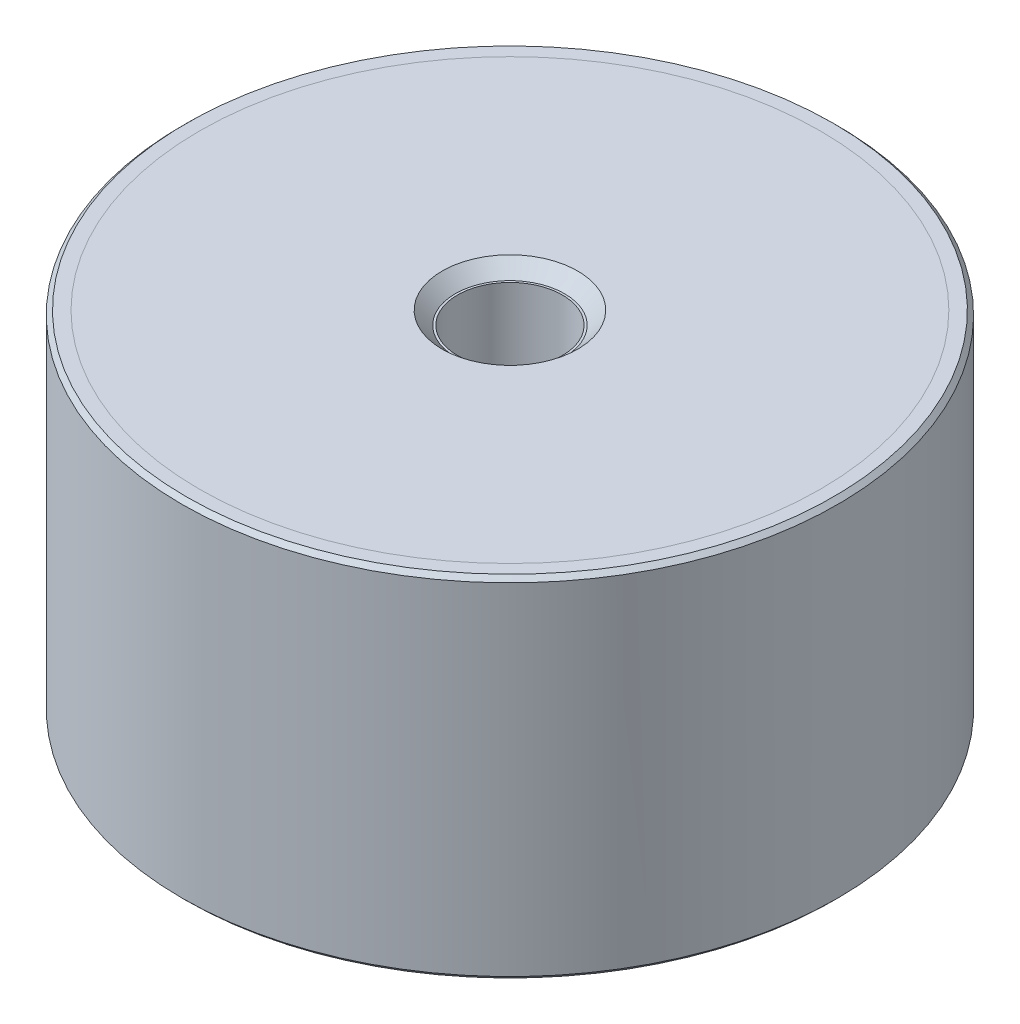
ISO-10303-21;
HEADER;
FILE_DESCRIPTION(('STEP AP214'),'2;1');
FILE_NAME('part.step','',(''),(''),'','','');
FILE_SCHEMA(('AUTOMOTIVE_DESIGN { 1 0 10303 214 1 1 1 1 }'));
ENDSEC;
DATA;
#1=APPLICATION_CONTEXT('core data for automotive mechanical design processes');
#2=APPLICATION_PROTOCOL_DEFINITION('international standard','automotive_design',2000,#1);
#3=PRODUCT_CONTEXT('',#1,'mechanical');
#4=PRODUCT('Part','Part','',(#3));
#5=PRODUCT_RELATED_PRODUCT_CATEGORY('part','',(#4));
#6=PRODUCT_DEFINITION_FORMATION('','',#4);
#7=PRODUCT_DEFINITION_CONTEXT('part definition',#1,'design');
#8=PRODUCT_DEFINITION('design','',#6,#7);
#9=PRODUCT_DEFINITION_SHAPE('','',#8);
#10=(LENGTH_UNIT() NAMED_UNIT(*) SI_UNIT(.MILLI.,.METRE.));
#11=(NAMED_UNIT(*) PLANE_ANGLE_UNIT() SI_UNIT($,.RADIAN.));
#12=(NAMED_UNIT(*) SI_UNIT($,.STERADIAN.) SOLID_ANGLE_UNIT());
#13=UNCERTAINTY_MEASURE_WITH_UNIT(LENGTH_MEASURE(1.E-05),#10,'distance_accuracy_value','');
#14=(GEOMETRIC_REPRESENTATION_CONTEXT(3) GLOBAL_UNCERTAINTY_ASSIGNED_CONTEXT((#13)) GLOBAL_UNIT_ASSIGNED_CONTEXT((#10,
#11,#12)) REPRESENTATION_CONTEXT('',''));
#15=CARTESIAN_POINT('',(0.,0.,0.));
#16=DIRECTION('',(0.,0.,1.));
#17=DIRECTION('',(1.,0.,0.));
#18=AXIS2_PLACEMENT_3D('',#15,#16,#17);
#19=CARTESIAN_POINT('',(0.,-37.,6.));
#20=DIRECTION('',(0.,1.,0.));
#21=DIRECTION('',(0.,0.,1.));
#22=AXIS2_PLACEMENT_3D('',#19,#20,#21);
#23=PLANE('',#22);
#24=CARTESIAN_POINT('',(0.,-37.,0.));
#25=DIRECTION('',(0.,1.,0.));
#26=DIRECTION('',(0.,0.,1.));
#27=AXIS2_PLACEMENT_3D('',#24,#25,#26);
#28=CIRCLE('',#27,6.25000000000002);
#29=CARTESIAN_POINT('',(0.,-37.,6.25000000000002));
#30=VERTEX_POINT('',#29);
#31=EDGE_CURVE('P0_E10',#30,#30,#28,.F.);
#32=ORIENTED_EDGE('',*,*,#31,.T.);
#33=EDGE_LOOP('',(#32));
#34=FACE_BOUND('',#33,.T.);
#35=CARTESIAN_POINT('',(0.,-37.,0.));
#36=DIRECTION('',(0.,1.,0.));
#37=DIRECTION('',(0.,0.,1.));
#38=AXIS2_PLACEMENT_3D('',#35,#36,#37);
#39=CIRCLE('',#38,35.5);
#40=CARTESIAN_POINT('',(0.,-37.,35.5));
#41=VERTEX_POINT('',#40);
#42=EDGE_CURVE('P0_E25',#41,#41,#39,.T.);
#43=ORIENTED_EDGE('',*,*,#42,.T.);
#44=EDGE_LOOP('',(#43));
#45=FACE_BOUND('',#44,.T.);
#46=ADVANCED_FACE('P0_F14',(#34,#45),#23,.T.);
#47=CARTESIAN_POINT('',(0.,31.0340428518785,0.));
#48=DIRECTION('',(0.,1.,0.));
#49=DIRECTION('',(0.,0.,1.));
#50=AXIS2_PLACEMENT_3D('',#47,#48,#49);
#51=CYLINDRICAL_SURFACE('',#50,35.5);
#52=CARTESIAN_POINT('',(0.,-38.5,0.));
#53=DIRECTION('',(0.,1.,0.));
#54=DIRECTION('',(0.,0.,1.));
#55=AXIS2_PLACEMENT_3D('',#52,#53,#54);
#56=CIRCLE('',#55,35.5);
#57=CARTESIAN_POINT('',(0.,-38.5,35.5));
#58=VERTEX_POINT('',#57);
#59=EDGE_CURVE('P0_E29',#58,#58,#56,.T.);
#60=ORIENTED_EDGE('',*,*,#59,.T.);
#61=EDGE_LOOP('',(#60));
#62=FACE_BOUND('',#61,.T.);
#63=ORIENTED_EDGE('',*,*,#42,.F.);
#64=EDGE_LOOP('',(#63));
#65=FACE_BOUND('',#64,.T.);
#66=ADVANCED_FACE('P0_F35',(#62,#65),#51,.T.);
#67=CARTESIAN_POINT('',(0.,-38.5,35.5));
#68=DIRECTION('',(0.,-1.,0.));
#69=DIRECTION('',(0.,0.,-1.));
#70=AXIS2_PLACEMENT_3D('',#67,#68,#69);
#71=PLANE('',#70);
#72=CARTESIAN_POINT('',(0.,-38.5,0.));
#73=DIRECTION('',(0.,-1.,0.));
#74=DIRECTION('',(0.,0.,-1.));
#75=AXIS2_PLACEMENT_3D('',#72,#73,#74);
#76=CIRCLE('',#75,7.75000000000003);
#77=CARTESIAN_POINT('',(0.,-38.5,-7.75000000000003));
#78=VERTEX_POINT('',#77);
#79=EDGE_CURVE('P0_E21',#78,#78,#76,.F.);
#80=ORIENTED_EDGE('',*,*,#79,.T.);
#81=EDGE_LOOP('',(#80));
#82=FACE_BOUND('',#81,.T.);
#83=ORIENTED_EDGE('',*,*,#59,.F.);
#84=EDGE_LOOP('',(#83));
#85=FACE_BOUND('',#84,.T.);
#86=ADVANCED_FACE('P0_F38',(#82,#85),#71,.T.);
#87=CARTESIAN_POINT('',(0.,-38.5,0.));
#88=DIRECTION('',(0.,-1.,0.));
#89=DIRECTION('',(0.,0.,-1.));
#90=AXIS2_PLACEMENT_3D('',#87,#88,#89);
#91=CONICAL_SURFACE('',#90,7.75000000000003,0.785398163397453);
#92=ORIENTED_EDGE('',*,*,#31,.F.);
#93=EDGE_LOOP('',(#92));
#94=FACE_BOUND('',#93,.T.);
#95=ORIENTED_EDGE('',*,*,#79,.F.);
#96=EDGE_LOOP('',(#95));
#97=FACE_BOUND('',#96,.T.);
#98=ADVANCED_FACE('P0_F16',(#94,#97),#91,.F.);
#99=CLOSED_SHELL('',(#46,#66,#86,#98));
#100=MANIFOLD_SOLID_BREP('P0_B1',#99);
#101=CARTESIAN_POINT('',(0.,1.5,6.));
#102=DIRECTION('',(0.,1.,0.));
#103=DIRECTION('',(0.,0.,1.));
#104=AXIS2_PLACEMENT_3D('',#101,#102,#103);
#105=PLANE('',#104);
#106=CARTESIAN_POINT('',(0.,1.5,0.));
#107=DIRECTION('',(0.,1.,0.));
#108=DIRECTION('',(0.,0.,1.));
#109=AXIS2_PLACEMENT_3D('',#106,#107,#108);
#110=CIRCLE('',#109,7.75000000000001);
#111=CARTESIAN_POINT('',(0.,1.5,7.75000000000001));
#112=VERTEX_POINT('',#111);
#113=EDGE_CURVE('P1_E10',#112,#112,#110,.F.);
#114=ORIENTED_EDGE('',*,*,#113,.T.);
#115=EDGE_LOOP('',(#114));
#116=FACE_BOUND('',#115,.T.);
#117=CARTESIAN_POINT('',(0.,1.5,0.));
#118=DIRECTION('',(0.,1.,0.));
#119=DIRECTION('',(0.,0.,1.));
#120=AXIS2_PLACEMENT_3D('',#117,#118,#119);
#121=CIRCLE('',#120,35.5);
#122=CARTESIAN_POINT('',(0.,1.5,35.5));
#123=VERTEX_POINT('',#122);
#124=EDGE_CURVE('P1_E25',#123,#123,#121,.T.);
#125=ORIENTED_EDGE('',*,*,#124,.T.);
#126=EDGE_LOOP('',(#125));
#127=FACE_BOUND('',#126,.T.);
#128=ADVANCED_FACE('P1_F14',(#116,#127),#105,.T.);
#129=CARTESIAN_POINT('',(0.,69.5340428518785,0.));
#130=DIRECTION('',(0.,1.,0.));
#131=DIRECTION('',(0.,0.,1.));
#132=AXIS2_PLACEMENT_3D('',#129,#130,#131);
#133=CYLINDRICAL_SURFACE('',#132,35.5);
#134=CARTESIAN_POINT('',(0.,0.,0.));
#135=DIRECTION('',(0.,1.,0.));
#136=DIRECTION('',(0.,0.,1.));
#137=AXIS2_PLACEMENT_3D('',#134,#135,#136);
#138=CIRCLE('',#137,35.5);
#139=CARTESIAN_POINT('',(0.,0.,35.5));
#140=VERTEX_POINT('',#139);
#141=EDGE_CURVE('P1_E29',#140,#140,#138,.T.);
#142=ORIENTED_EDGE('',*,*,#141,.T.);
#143=EDGE_LOOP('',(#142));
#144=FACE_BOUND('',#143,.T.);
#145=ORIENTED_EDGE('',*,*,#124,.F.);
#146=EDGE_LOOP('',(#145));
#147=FACE_BOUND('',#146,.T.);
#148=ADVANCED_FACE('P1_F35',(#144,#147),#133,.T.);
#149=CARTESIAN_POINT('',(0.,0.,35.5));
#150=DIRECTION('',(0.,-1.,0.));
#151=DIRECTION('',(0.,0.,-1.));
#152=AXIS2_PLACEMENT_3D('',#149,#150,#151);
#153=PLANE('',#152);
#154=CARTESIAN_POINT('',(0.,0.,0.));
#155=DIRECTION('',(0.,-1.,0.));
#156=DIRECTION('',(0.,0.,-1.));
#157=AXIS2_PLACEMENT_3D('',#154,#155,#156);
#158=CIRCLE('',#157,6.25000000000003);
#159=CARTESIAN_POINT('',(0.,0.,-6.25000000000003));
#160=VERTEX_POINT('',#159);
#161=EDGE_CURVE('P1_E21',#160,#160,#158,.F.);
#162=ORIENTED_EDGE('',*,*,#161,.T.);
#163=EDGE_LOOP('',(#162));
#164=FACE_BOUND('',#163,.T.);
#165=ORIENTED_EDGE('',*,*,#141,.F.);
#166=EDGE_LOOP('',(#165));
#167=FACE_BOUND('',#166,.T.);
#168=ADVANCED_FACE('P1_F38',(#164,#167),#153,.T.);
#169=CARTESIAN_POINT('',(0.,-0.250000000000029,0.));
#170=DIRECTION('',(0.,1.,0.));
#171=DIRECTION('',(0.,0.,1.));
#172=AXIS2_PLACEMENT_3D('',#169,#170,#171);
#173=CONICAL_SURFACE('',#172,6.,0.785398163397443);
#174=ORIENTED_EDGE('',*,*,#113,.F.);
#175=EDGE_LOOP('',(#174));
#176=FACE_BOUND('',#175,.T.);
#177=ORIENTED_EDGE('',*,*,#161,.F.);
#178=EDGE_LOOP('',(#177));
#179=FACE_BOUND('',#178,.T.);
#180=ADVANCED_FACE('P1_F16',(#176,#179),#173,.F.);
#181=CLOSED_SHELL('',(#128,#148,#168,#180));
#182=MANIFOLD_SOLID_BREP('P1_B1',#181);
#183=CARTESIAN_POINT('',(0.,0.,0.));
#184=DIRECTION('',(0.,1.,0.));
#185=DIRECTION('',(0.,0.,1.));
#186=AXIS2_PLACEMENT_3D('',#183,#184,#185);
#187=PLANE('',#186);
#188=CARTESIAN_POINT('',(0.,0.,0.));
#189=DIRECTION('',(0.,1.,0.));
#190=DIRECTION('',(0.,0.,1.));
#191=AXIS2_PLACEMENT_3D('',#188,#189,#190);
#192=CIRCLE('',#191,6.);
#193=CARTESIAN_POINT('',(0.,0.,6.));
#194=VERTEX_POINT('',#193);
#195=EDGE_CURVE('P2_E46',#194,#194,#192,.T.);
#196=ORIENTED_EDGE('',*,*,#195,.F.);
#197=EDGE_LOOP('',(#196));
#198=FACE_BOUND('',#197,.T.);
#199=CARTESIAN_POINT('',(0.,0.,0.));
#200=DIRECTION('',(0.,1.,0.));
#201=DIRECTION('',(0.,0.,1.));
#202=AXIS2_PLACEMENT_3D('',#199,#200,#201);
#203=CIRCLE('',#202,35.5);
#204=CARTESIAN_POINT('',(0.,0.,35.5));
#205=VERTEX_POINT('',#204);
#206=EDGE_CURVE('P2_E33',#205,#205,#203,.T.);
#207=ORIENTED_EDGE('',*,*,#206,.T.);
#208=EDGE_LOOP('',(#207));
#209=FACE_BOUND('',#208,.T.);
#210=ADVANCED_FACE('P2_F13',(#198,#209),#187,.T.);
#211=CARTESIAN_POINT('',(0.,65.5134936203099,0.));
#212=DIRECTION('',(0.,1.,0.));
#213=DIRECTION('',(0.,0.,1.));
#214=AXIS2_PLACEMENT_3D('',#211,#212,#213);
#215=CYLINDRICAL_SURFACE('',#214,35.5);
#216=CARTESIAN_POINT('',(0.,1.5,0.));
#217=DIRECTION('',(0.,1.,0.));
#218=DIRECTION('',(0.,0.,1.));
#219=AXIS2_PLACEMENT_3D('',#216,#217,#218);
#220=CIRCLE('',#219,35.5);
#221=CARTESIAN_POINT('',(0.,1.5,35.5));
#222=VERTEX_POINT('',#221);
#223=EDGE_CURVE('P2_E36',#222,#222,#220,.T.);
#224=ORIENTED_EDGE('',*,*,#223,.T.);
#225=EDGE_LOOP('',(#224));
#226=FACE_BOUND('',#225,.T.);
#227=ORIENTED_EDGE('',*,*,#206,.F.);
#228=EDGE_LOOP('',(#227));
#229=FACE_BOUND('',#228,.T.);
#230=ADVANCED_FACE('P2_F92',(#226,#229),#215,.F.);
#231=CARTESIAN_POINT('',(0.,1.5,35.5));
#232=DIRECTION('',(0.,1.,0.));
#233=DIRECTION('',(0.,0.,1.));
#234=AXIS2_PLACEMENT_3D('',#231,#232,#233);
#235=PLANE('',#234);
#236=CARTESIAN_POINT('',(0.,1.5,0.));
#237=DIRECTION('',(0.,1.,0.));
#238=DIRECTION('',(0.,0.,1.));
#239=AXIS2_PLACEMENT_3D('',#236,#237,#238);
#240=CIRCLE('',#239,37.);
#241=CARTESIAN_POINT('',(0.,1.5,37.));
#242=VERTEX_POINT('',#241);
#243=EDGE_CURVE('P2_E9',#242,#242,#240,.T.);
#244=ORIENTED_EDGE('',*,*,#243,.T.);
#245=EDGE_LOOP('',(#244));
#246=FACE_BOUND('',#245,.T.);
#247=ORIENTED_EDGE('',*,*,#223,.F.);
#248=EDGE_LOOP('',(#247));
#249=FACE_BOUND('',#248,.T.);
#250=ADVANCED_FACE('P2_F88',(#246,#249),#235,.T.);
#251=CARTESIAN_POINT('',(0.,65.5134936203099,0.));
#252=DIRECTION('',(0.,1.,0.));
#253=DIRECTION('',(0.,0.,1.));
#254=AXIS2_PLACEMENT_3D('',#251,#252,#253);
#255=CYLINDRICAL_SURFACE('',#254,37.5);
#256=CARTESIAN_POINT('',(0.,-38.,0.));
#257=DIRECTION('',(0.,-1.,0.));
#258=DIRECTION('',(0.,0.,-1.));
#259=AXIS2_PLACEMENT_3D('',#256,#257,#258);
#260=CIRCLE('',#259,37.5);
#261=CARTESIAN_POINT('',(0.,-38.,-37.5));
#262=VERTEX_POINT('',#261);
#263=EDGE_CURVE('P2_E24',#262,#262,#260,.F.);
#264=ORIENTED_EDGE('',*,*,#263,.T.);
#265=EDGE_LOOP('',(#264));
#266=FACE_BOUND('',#265,.T.);
#267=CARTESIAN_POINT('',(0.,1.00000000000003,0.));
#268=DIRECTION('',(0.,1.,0.));
#269=DIRECTION('',(0.,0.,1.));
#270=AXIS2_PLACEMENT_3D('',#267,#268,#269);
#271=CIRCLE('',#270,37.5);
#272=CARTESIAN_POINT('',(0.,1.00000000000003,37.5));
#273=VERTEX_POINT('',#272);
#274=EDGE_CURVE('P2_E28',#273,#273,#271,.F.);
#275=ORIENTED_EDGE('',*,*,#274,.T.);
#276=EDGE_LOOP('',(#275));
#277=FACE_BOUND('',#276,.T.);
#278=ADVANCED_FACE('P2_F82',(#266,#277),#255,.T.);
#279=CARTESIAN_POINT('',(0.,-38.5,37.5));
#280=DIRECTION('',(0.,-1.,0.));
#281=DIRECTION('',(0.,0.,-1.));
#282=AXIS2_PLACEMENT_3D('',#279,#280,#281);
#283=PLANE('',#282);
#284=CARTESIAN_POINT('',(0.,-38.5,0.));
#285=DIRECTION('',(0.,-1.,0.));
#286=DIRECTION('',(0.,0.,-1.));
#287=AXIS2_PLACEMENT_3D('',#284,#285,#286);
#288=CIRCLE('',#287,37.);
#289=CARTESIAN_POINT('',(0.,-38.5,-37.));
#290=VERTEX_POINT('',#289);
#291=EDGE_CURVE('P2_E20',#290,#290,#288,.T.);
#292=ORIENTED_EDGE('',*,*,#291,.T.);
#293=EDGE_LOOP('',(#292));
#294=FACE_BOUND('',#293,.T.);
#295=CARTESIAN_POINT('',(0.,-38.5,0.));
#296=DIRECTION('',(0.,1.,0.));
#297=DIRECTION('',(0.,0.,1.));
#298=AXIS2_PLACEMENT_3D('',#295,#296,#297);
#299=CIRCLE('',#298,35.5);
#300=CARTESIAN_POINT('',(0.,-38.5,35.5));
#301=VERTEX_POINT('',#300);
#302=EDGE_CURVE('P2_E39',#301,#301,#299,.T.);
#303=ORIENTED_EDGE('',*,*,#302,.T.);
#304=EDGE_LOOP('',(#303));
#305=FACE_BOUND('',#304,.T.);
#306=ADVANCED_FACE('P2_F77',(#294,#305),#283,.T.);
#307=CARTESIAN_POINT('',(0.,65.5134936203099,0.));
#308=DIRECTION('',(0.,1.,0.));
#309=DIRECTION('',(0.,0.,1.));
#310=AXIS2_PLACEMENT_3D('',#307,#308,#309);
#311=CYLINDRICAL_SURFACE('',#310,35.5);
#312=CARTESIAN_POINT('',(0.,-37.,0.));
#313=DIRECTION('',(0.,1.,0.));
#314=DIRECTION('',(0.,0.,1.));
#315=AXIS2_PLACEMENT_3D('',#312,#313,#314);
#316=CIRCLE('',#315,35.5);
#317=CARTESIAN_POINT('',(0.,-37.,35.5));
#318=VERTEX_POINT('',#317);
#319=EDGE_CURVE('P2_E42',#318,#318,#316,.T.);
#320=ORIENTED_EDGE('',*,*,#319,.T.);
#321=EDGE_LOOP('',(#320));
#322=FACE_BOUND('',#321,.T.);
#323=ORIENTED_EDGE('',*,*,#302,.F.);
#324=EDGE_LOOP('',(#323));
#325=FACE_BOUND('',#324,.T.);
#326=ADVANCED_FACE('P2_F71',(#322,#325),#311,.F.);
#327=CARTESIAN_POINT('',(0.,-37.,35.5));
#328=DIRECTION('',(0.,-1.,0.));
#329=DIRECTION('',(0.,0.,-1.));
#330=AXIS2_PLACEMENT_3D('',#327,#328,#329);
#331=PLANE('',#330);
#332=CARTESIAN_POINT('',(0.,-37.,0.));
#333=DIRECTION('',(0.,-1.,0.));
#334=DIRECTION('',(0.,0.,-1.));
#335=AXIS2_PLACEMENT_3D('',#332,#333,#334);
#336=CIRCLE('',#335,6.);
#337=CARTESIAN_POINT('',(0.,-37.,-6.));
#338=VERTEX_POINT('',#337);
#339=EDGE_CURVE('P2_E52',#338,#338,#336,.T.);
#340=ORIENTED_EDGE('',*,*,#339,.F.);
#341=EDGE_LOOP('',(#340));
#342=FACE_BOUND('',#341,.T.);
#343=ORIENTED_EDGE('',*,*,#319,.F.);
#344=EDGE_LOOP('',(#343));
#345=FACE_BOUND('',#344,.T.);
#346=ADVANCED_FACE('P2_F67',(#342,#345),#331,.T.);
#347=CARTESIAN_POINT('',(0.,-38.,0.));
#348=DIRECTION('',(0.,1.,0.));
#349=DIRECTION('',(0.,0.,1.));
#350=AXIS2_PLACEMENT_3D('',#347,#348,#349);
#351=CONICAL_SURFACE('',#350,37.5,0.785398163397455);
#352=ORIENTED_EDGE('',*,*,#291,.F.);
#353=EDGE_LOOP('',(#352));
#354=FACE_BOUND('',#353,.T.);
#355=ORIENTED_EDGE('',*,*,#263,.F.);
#356=EDGE_LOOP('',(#355));
#357=FACE_BOUND('',#356,.T.);
#358=ADVANCED_FACE('P2_F70',(#354,#357),#351,.T.);
#359=CARTESIAN_POINT('',(0.,1.5,0.));
#360=DIRECTION('',(0.,-1.,0.));
#361=DIRECTION('',(0.,0.,-1.));
#362=AXIS2_PLACEMENT_3D('',#359,#360,#361);
#363=CONICAL_SURFACE('',#362,37.,0.785398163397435);
#364=ORIENTED_EDGE('',*,*,#274,.F.);
#365=EDGE_LOOP('',(#364));
#366=FACE_BOUND('',#365,.T.);
#367=ORIENTED_EDGE('',*,*,#243,.F.);
#368=EDGE_LOOP('',(#367));
#369=FACE_BOUND('',#368,.T.);
#370=ADVANCED_FACE('P2_F15',(#366,#369),#363,.T.);
#371=CARTESIAN_POINT('',(0.,-10.5,0.));
#372=DIRECTION('',(0.,1.,0.));
#373=DIRECTION('',(0.,0.,1.));
#374=AXIS2_PLACEMENT_3D('',#371,#372,#373);
#375=CYLINDRICAL_SURFACE('',#374,6.);
#376=CARTESIAN_POINT('',(0.,-10.5,0.));
#377=DIRECTION('',(0.,1.,0.));
#378=DIRECTION('',(0.,0.,1.));
#379=AXIS2_PLACEMENT_3D('',#376,#377,#378);
#380=CIRCLE('',#379,6.);
#381=CARTESIAN_POINT('',(0.,-10.5,6.));
#382=VERTEX_POINT('',#381);
#383=EDGE_CURVE('P2_E45',#382,#382,#380,.T.);
#384=CARTESIAN_POINT('',(0.,-10.5,6.));
#385=CARTESIAN_POINT('',(0.,-10.390625,6.));
#386=CARTESIAN_POINT('',(0.,-10.28125,6.));
#387=CARTESIAN_POINT('',(0.,-10.0625,6.));
#388=CARTESIAN_POINT('',(0.,-9.953125,6.));
#389=CARTESIAN_POINT('',(0.,-9.734375,6.));
#390=CARTESIAN_POINT('',(0.,-9.625,6.));
#391=CARTESIAN_POINT('',(0.,-9.40625,6.));
#392=CARTESIAN_POINT('',(0.,-9.296875,6.));
#393=CARTESIAN_POINT('',(0.,-9.078125,6.));
#394=CARTESIAN_POINT('',(0.,-8.96875,6.));
#395=CARTESIAN_POINT('',(0.,-8.75,6.));
#396=CARTESIAN_POINT('',(0.,-8.640625,6.));
#397=CARTESIAN_POINT('',(0.,-8.421875,6.));
#398=CARTESIAN_POINT('',(0.,-8.3125,6.));
#399=CARTESIAN_POINT('',(0.,-8.09375,6.));
#400=CARTESIAN_POINT('',(0.,-7.984375,6.));
#401=CARTESIAN_POINT('',(0.,-7.765625,6.));
#402=CARTESIAN_POINT('',(0.,-7.65625,6.));
#403=CARTESIAN_POINT('',(0.,-7.4375,6.));
#404=CARTESIAN_POINT('',(0.,-7.328125,6.));
#405=CARTESIAN_POINT('',(0.,-7.109375,6.));
#406=CARTESIAN_POINT('',(0.,-7.,6.));
#407=CARTESIAN_POINT('',(0.,-6.78125,6.));
#408=CARTESIAN_POINT('',(0.,-6.671875,6.));
#409=CARTESIAN_POINT('',(0.,-6.453125,6.));
#410=CARTESIAN_POINT('',(0.,-6.34375,6.));
#411=CARTESIAN_POINT('',(0.,-6.125,6.));
#412=CARTESIAN_POINT('',(0.,-6.015625,6.));
#413=CARTESIAN_POINT('',(0.,-5.796875,6.));
#414=CARTESIAN_POINT('',(0.,-5.6875,6.));
#415=CARTESIAN_POINT('',(0.,-5.46875,6.));
#416=CARTESIAN_POINT('',(0.,-5.359375,6.));
#417=CARTESIAN_POINT('',(0.,-5.140625,6.));
#418=CARTESIAN_POINT('',(0.,-5.03125,6.));
#419=CARTESIAN_POINT('',(0.,-4.8125,6.));
#420=CARTESIAN_POINT('',(0.,-4.703125,6.));
#421=CARTESIAN_POINT('',(0.,-4.484375,6.));
#422=CARTESIAN_POINT('',(0.,-4.375,6.));
#423=CARTESIAN_POINT('',(0.,-4.15625,6.));
#424=CARTESIAN_POINT('',(0.,-4.046875,6.));
#425=CARTESIAN_POINT('',(0.,-3.828125,6.));
#426=CARTESIAN_POINT('',(0.,-3.71875,6.));
#427=CARTESIAN_POINT('',(0.,-3.5,6.));
#428=CARTESIAN_POINT('',(0.,-3.390625,6.));
#429=CARTESIAN_POINT('',(0.,-3.171875,6.));
#430=CARTESIAN_POINT('',(0.,-3.0625,6.));
#431=CARTESIAN_POINT('',(0.,-2.84375,6.));
#432=CARTESIAN_POINT('',(0.,-2.734375,6.));
#433=CARTESIAN_POINT('',(0.,-2.515625,6.));
#434=CARTESIAN_POINT('',(0.,-2.40625,6.));
#435=CARTESIAN_POINT('',(0.,-2.1875,6.));
#436=CARTESIAN_POINT('',(0.,-2.078125,6.));
#437=CARTESIAN_POINT('',(0.,-1.859375,6.));
#438=CARTESIAN_POINT('',(0.,-1.75,6.));
#439=CARTESIAN_POINT('',(0.,-1.53125,6.));
#440=CARTESIAN_POINT('',(0.,-1.421875,6.));
#441=CARTESIAN_POINT('',(0.,-1.203125,6.));
#442=CARTESIAN_POINT('',(0.,-1.09375,6.));
#443=CARTESIAN_POINT('',(0.,-0.875000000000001,6.));
#444=CARTESIAN_POINT('',(0.,-0.765625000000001,6.));
#445=CARTESIAN_POINT('',(0.,-0.546875,6.));
#446=CARTESIAN_POINT('',(0.,-0.4375,6.));
#447=CARTESIAN_POINT('',(0.,-0.21875,6.));
#448=CARTESIAN_POINT('',(0.,-0.109375,6.));
#449=CARTESIAN_POINT('',(0.,0.,6.));
#450=B_SPLINE_CURVE_WITH_KNOTS('',3,(#384,#385,#386,#387,#388,#389,#390,#391,#392,#393,#394,
#395,#396,#397,#398,#399,#400,#401,#402,#403,#404,#405,#406,#407,#408,#409,#410,#411,#412,#413,
#414,#415,#416,#417,#418,#419,#420,#421,#422,#423,#424,#425,#426,#427,#428,#429,#430,#431,#432,
#433,#434,#435,#436,#437,#438,#439,#440,#441,#442,#443,#444,#445,#446,#447,#448,#449),
.UNSPECIFIED.,.F.,.F.,(4,2,2,2,2,2,2,2,2,2,2,2,2,2,2,2,2,2,2,2,2,2,2,2,2,2,2,2,2,2,2,2,4),(0.,
0.328124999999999,0.656249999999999,0.984374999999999,1.3125,1.640625,1.96875,2.296875,2.625,
2.953125,3.28125,3.609375,3.9375,4.265625,4.59375,4.921875,5.25,5.578125,5.90625,6.234375,
6.5625,6.890625,7.21875,7.546875,7.875,8.203125,8.53125,8.859375,9.1875,9.515625,9.84375,
10.171875,10.5),.UNSPECIFIED.);
#451=EDGE_CURVE('P2_BSEAM108',#382,#194,#450,.T.);
#452=ORIENTED_EDGE('',*,*,#383,.F.);
#453=ORIENTED_EDGE('',*,*,#195,.T.);
#454=ORIENTED_EDGE('',*,*,#451,.T.);
#455=ORIENTED_EDGE('',*,*,#451,.F.);
#456=EDGE_LOOP('',(#452,#454,#453,#455));
#457=FACE_BOUND('',#456,.T.);
#458=ADVANCED_FACE('P2_F108',(#457),#375,.F.);
#459=CARTESIAN_POINT('',(0.,-10.5,0.));
#460=DIRECTION('',(0.,1.,0.));
#461=DIRECTION('',(0.,0.,1.));
#462=AXIS2_PLACEMENT_3D('',#459,#460,#461);
#463=PLANE('',#462);
#464=ORIENTED_EDGE('',*,*,#383,.T.);
#465=EDGE_LOOP('',(#464));
#466=FACE_BOUND('',#465,.T.);
#467=ADVANCED_FACE('P2_F63',(#466),#463,.T.);
#468=CARTESIAN_POINT('',(0.,-26.5,0.));
#469=DIRECTION('',(0.,-1.,0.));
#470=DIRECTION('',(0.,0.,-1.));
#471=AXIS2_PLACEMENT_3D('',#468,#469,#470);
#472=CYLINDRICAL_SURFACE('',#471,6.);
#473=CARTESIAN_POINT('',(0.,-26.5,0.));
#474=DIRECTION('',(0.,-1.,0.));
#475=DIRECTION('',(0.,0.,-1.));
#476=AXIS2_PLACEMENT_3D('',#473,#474,#475);
#477=CIRCLE('',#476,6.);
#478=CARTESIAN_POINT('',(0.,-26.5,-6.));
#479=VERTEX_POINT('',#478);
#480=EDGE_CURVE('P2_E49',#479,#479,#477,.T.);
#481=CARTESIAN_POINT('',(0.,-26.5,-6.));
#482=CARTESIAN_POINT('',(0.,-26.609375,-6.));
#483=CARTESIAN_POINT('',(0.,-26.71875,-6.));
#484=CARTESIAN_POINT('',(0.,-26.9375,-6.));
#485=CARTESIAN_POINT('',(0.,-27.046875,-6.));
#486=CARTESIAN_POINT('',(0.,-27.265625,-6.));
#487=CARTESIAN_POINT('',(0.,-27.375,-6.));
#488=CARTESIAN_POINT('',(0.,-27.59375,-6.));
#489=CARTESIAN_POINT('',(0.,-27.703125,-6.));
#490=CARTESIAN_POINT('',(0.,-27.921875,-6.));
#491=CARTESIAN_POINT('',(0.,-28.03125,-6.));
#492=CARTESIAN_POINT('',(0.,-28.25,-6.));
#493=CARTESIAN_POINT('',(0.,-28.359375,-6.));
#494=CARTESIAN_POINT('',(0.,-28.578125,-6.));
#495=CARTESIAN_POINT('',(0.,-28.6875,-6.));
#496=CARTESIAN_POINT('',(0.,-28.90625,-6.));
#497=CARTESIAN_POINT('',(0.,-29.015625,-6.));
#498=CARTESIAN_POINT('',(0.,-29.234375,-6.));
#499=CARTESIAN_POINT('',(0.,-29.34375,-6.));
#500=CARTESIAN_POINT('',(0.,-29.5625,-6.));
#501=CARTESIAN_POINT('',(0.,-29.671875,-6.));
#502=CARTESIAN_POINT('',(0.,-29.890625,-6.));
#503=CARTESIAN_POINT('',(0.,-30.,-6.));
#504=CARTESIAN_POINT('',(0.,-30.21875,-6.));
#505=CARTESIAN_POINT('',(0.,-30.328125,-6.));
#506=CARTESIAN_POINT('',(0.,-30.546875,-6.));
#507=CARTESIAN_POINT('',(0.,-30.65625,-6.));
#508=CARTESIAN_POINT('',(0.,-30.875,-6.));
#509=CARTESIAN_POINT('',(0.,-30.984375,-6.));
#510=CARTESIAN_POINT('',(0.,-31.203125,-6.));
#511=CARTESIAN_POINT('',(0.,-31.3125,-6.));
#512=CARTESIAN_POINT('',(0.,-31.53125,-6.));
#513=CARTESIAN_POINT('',(0.,-31.640625,-6.));
#514=CARTESIAN_POINT('',(0.,-31.859375,-6.));
#515=CARTESIAN_POINT('',(0.,-31.96875,-6.));
#516=CARTESIAN_POINT('',(0.,-32.1875,-6.));
#517=CARTESIAN_POINT('',(0.,-32.296875,-6.));
#518=CARTESIAN_POINT('',(0.,-32.515625,-6.));
#519=CARTESIAN_POINT('',(0.,-32.625,-6.));
#520=CARTESIAN_POINT('',(0.,-32.84375,-6.));
#521=CARTESIAN_POINT('',(0.,-32.953125,-6.));
#522=CARTESIAN_POINT('',(0.,-33.171875,-6.));
#523=CARTESIAN_POINT('',(0.,-33.28125,-6.));
#524=CARTESIAN_POINT('',(0.,-33.5,-6.));
#525=CARTESIAN_POINT('',(0.,-33.609375,-6.));
#526=CARTESIAN_POINT('',(0.,-33.828125,-6.));
#527=CARTESIAN_POINT('',(0.,-33.9375,-6.));
#528=CARTESIAN_POINT('',(0.,-34.15625,-6.));
#529=CARTESIAN_POINT('',(0.,-34.265625,-6.));
#530=CARTESIAN_POINT('',(0.,-34.484375,-6.));
#531=CARTESIAN_POINT('',(0.,-34.59375,-6.));
#532=CARTESIAN_POINT('',(0.,-34.8125,-6.));
#533=CARTESIAN_POINT('',(0.,-34.921875,-6.));
#534=CARTESIAN_POINT('',(0.,-35.140625,-6.));
#535=CARTESIAN_POINT('',(0.,-35.25,-6.));
#536=CARTESIAN_POINT('',(0.,-35.46875,-6.));
#537=CARTESIAN_POINT('',(0.,-35.578125,-6.));
#538=CARTESIAN_POINT('',(0.,-35.796875,-6.));
#539=CARTESIAN_POINT('',(0.,-35.90625,-6.));
#540=CARTESIAN_POINT('',(0.,-36.125,-6.));
#541=CARTESIAN_POINT('',(0.,-36.234375,-6.));
#542=CARTESIAN_POINT('',(0.,-36.453125,-6.));
#543=CARTESIAN_POINT('',(0.,-36.5625,-6.));
#544=CARTESIAN_POINT('',(0.,-36.78125,-6.));
#545=CARTESIAN_POINT('',(0.,-36.890625,-6.));
#546=CARTESIAN_POINT('',(0.,-37.,-6.));
#547=B_SPLINE_CURVE_WITH_KNOTS('',3,(#481,#482,#483,#484,#485,#486,#487,#488,#489,#490,#491,
#492,#493,#494,#495,#496,#497,#498,#499,#500,#501,#502,#503,#504,#505,#506,#507,#508,#509,#510,
#511,#512,#513,#514,#515,#516,#517,#518,#519,#520,#521,#522,#523,#524,#525,#526,#527,#528,#529,
#530,#531,#532,#533,#534,#535,#536,#537,#538,#539,#540,#541,#542,#543,#544,#545,#546),
.UNSPECIFIED.,.F.,.F.,(4,2,2,2,2,2,2,2,2,2,2,2,2,2,2,2,2,2,2,2,2,2,2,2,2,2,2,2,2,2,2,2,4),(0.,
0.328124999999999,0.656249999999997,0.984374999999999,1.3125,1.640625,1.96875,2.296875,2.625,
2.953125,3.28125,3.609375,3.9375,4.265625,4.59375,4.921875,5.25,5.578125,5.90624999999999,
6.234375,6.5625,6.890625,7.21875,7.546875,7.875,8.203125,8.53125,8.859375,9.18749999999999,
9.51562499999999,9.84375,10.171875,10.5),.UNSPECIFIED.);
#548=EDGE_CURVE('P2_BSEAM60',#479,#338,#547,.T.);
#549=ORIENTED_EDGE('',*,*,#480,.F.);
#550=ORIENTED_EDGE('',*,*,#339,.T.);
#551=ORIENTED_EDGE('',*,*,#548,.T.);
#552=ORIENTED_EDGE('',*,*,#548,.F.);
#553=EDGE_LOOP('',(#549,#551,#550,#552));
#554=FACE_BOUND('',#553,.T.);
#555=ADVANCED_FACE('P2_F60',(#554),#472,.F.);
#556=CARTESIAN_POINT('',(0.,-26.5,0.));
#557=DIRECTION('',(0.,-1.,0.));
#558=DIRECTION('',(0.,0.,-1.));
#559=AXIS2_PLACEMENT_3D('',#556,#557,#558);
#560=PLANE('',#559);
#561=ORIENTED_EDGE('',*,*,#480,.T.);
#562=EDGE_LOOP('',(#561));
#563=FACE_BOUND('',#562,.T.);
#564=ADVANCED_FACE('P2_F58',(#563),#560,.T.);
#565=CLOSED_SHELL('',(#210,#230,#250,#278,#306,#326,#346,#358,#370,#458,#467,#555,#564));
#566=MANIFOLD_SOLID_BREP('P2_B1',#565);
#567=ADVANCED_BREP_SHAPE_REPRESENTATION('',(#18,#100,#182,#566),#14);
#568=SHAPE_DEFINITION_REPRESENTATION(#9,#567);
ENDSEC;
END-ISO-10303-21;
